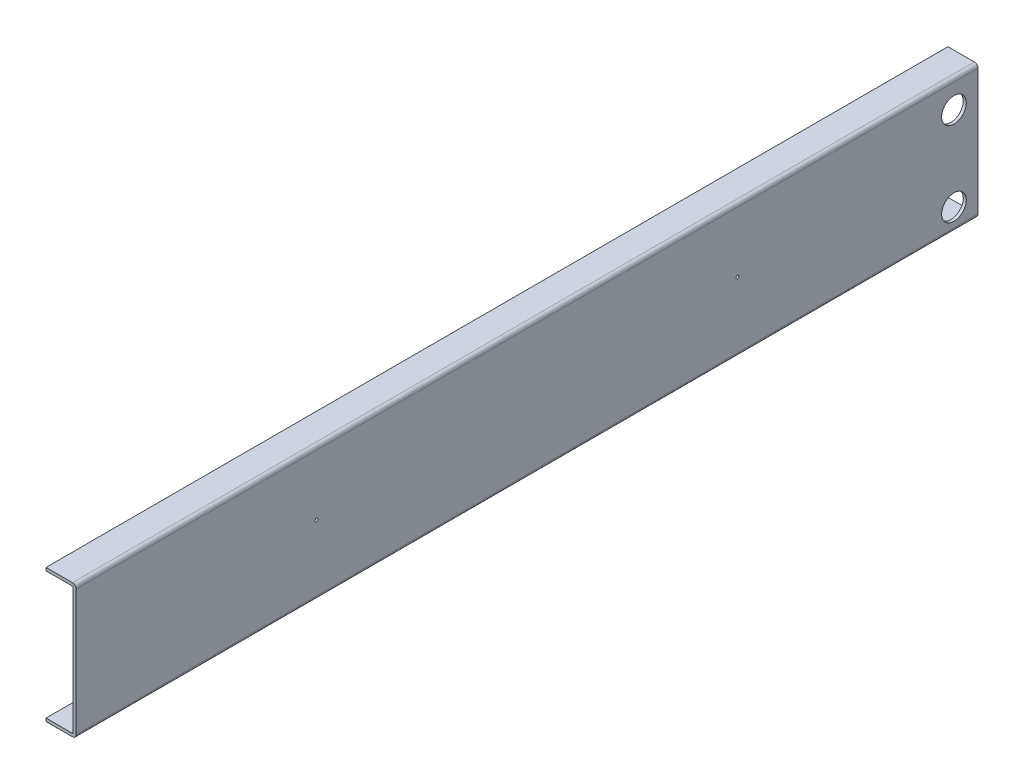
from build123d import *

# Parameters (mm, degrees)
BASE_EXTRUSION_DEPTH    = 1500
ESQUISSE2_R             = 20.5
ESQUISSE2_R_2           = 2.5
ENL_V_MAT_EXTRU_1_DEPTH = 10


with BuildPart() as part:
    # Esquisse1 → Base-Extrusion (new body)
    with BuildSketch(Plane.XY):
        with BuildLine():
            Line((0, 0), (44, 0))
            ThreePointArc((44, 0), (48.242640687, -1.757359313), (50, -6))
            Line((50, -6), (50, -216))
            ThreePointArc((50, -216), (48.242640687, -220.242640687), (44, -222))
            Line((44, -222), (0, -222))
            Line((0, -222), (0, -217))
            Line((0, -217), (44, -217))
            ThreePointArc((44, -217), (44.707106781, -216.707106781), (45, -216))
            Line((45, -216), (45, -6))
            ThreePointArc((45, -6), (44.707106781, -5.292893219), (44, -5))
            Line((44, -5), (0, -5))
            Line((0, -5), (0, 0))
        make_face()
    extrude(amount=BASE_EXTRUSION_DEPTH)

    # Esquisse2 → Enl_v. mat.-Extru.1 (cut)
    with BuildSketch(Plane(origin=(50, 0, 0), x_dir=(0, 0, -1), z_dir=(1, 0, 0))):
        with Locations(Location((-40, -46, 0), (0, 0, 90))):
            Circle(ESQUISSE2_R)
        with Locations(Location((-40, -186, 0), (0, 0, 90))):
            Circle(ESQUISSE2_R)
        with Locations(Location((-400, -106.783687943, 0), (0, 0, 90))):
            Circle(ESQUISSE2_R_2)
        with Locations(Location((-1100, -106.783687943, 0), (0, 0, 90))):
            Circle(ESQUISSE2_R_2)
    extrude(amount=-ENL_V_MAT_EXTRU_1_DEPTH, mode=Mode.SUBTRACT)


solid = part.part
